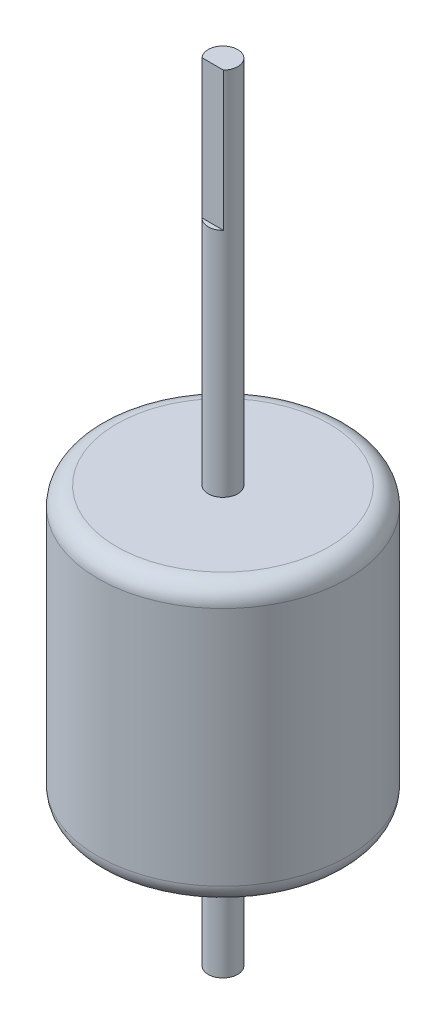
ISO-10303-21;
HEADER;
FILE_DESCRIPTION(('STEP AP214'),'2;1');
FILE_NAME('part.step','',(''),(''),'','','');
FILE_SCHEMA(('AUTOMOTIVE_DESIGN { 1 0 10303 214 1 1 1 1 }'));
ENDSEC;
DATA;
#1=APPLICATION_CONTEXT('core data for automotive mechanical design processes');
#2=APPLICATION_PROTOCOL_DEFINITION('international standard','automotive_design',2000,#1);
#3=PRODUCT_CONTEXT('',#1,'mechanical');
#4=PRODUCT('Part','Part','',(#3));
#5=PRODUCT_RELATED_PRODUCT_CATEGORY('part','',(#4));
#6=PRODUCT_DEFINITION_FORMATION('','',#4);
#7=PRODUCT_DEFINITION_CONTEXT('part definition',#1,'design');
#8=PRODUCT_DEFINITION('design','',#6,#7);
#9=PRODUCT_DEFINITION_SHAPE('','',#8);
#10=(LENGTH_UNIT() NAMED_UNIT(*) SI_UNIT(.MILLI.,.METRE.));
#11=(NAMED_UNIT(*) PLANE_ANGLE_UNIT() SI_UNIT($,.RADIAN.));
#12=(NAMED_UNIT(*) SI_UNIT($,.STERADIAN.) SOLID_ANGLE_UNIT());
#13=UNCERTAINTY_MEASURE_WITH_UNIT(LENGTH_MEASURE(1.E-05),#10,'distance_accuracy_value','');
#14=(GEOMETRIC_REPRESENTATION_CONTEXT(3) GLOBAL_UNCERTAINTY_ASSIGNED_CONTEXT((#13)) GLOBAL_UNIT_ASSIGNED_CONTEXT((#10,
#11,#12)) REPRESENTATION_CONTEXT('',''));
#15=CARTESIAN_POINT('',(0.,0.,0.));
#16=DIRECTION('',(0.,0.,1.));
#17=DIRECTION('',(1.,0.,0.));
#18=AXIS2_PLACEMENT_3D('',#15,#16,#17);
#19=CARTESIAN_POINT('',(0.,0.,0.));
#20=DIRECTION('',(0.,-1.,0.));
#21=DIRECTION('',(0.,0.,-1.));
#22=AXIS2_PLACEMENT_3D('',#19,#20,#21);
#23=CYLINDRICAL_SURFACE('',#22,1.6);
#24=CARTESIAN_POINT('',(0.,15.,0.));
#25=DIRECTION('',(0.,-1.,0.));
#26=DIRECTION('',(0.,0.,-1.));
#27=AXIS2_PLACEMENT_3D('',#24,#25,#26);
#28=CIRCLE('',#27,1.6);
#29=CARTESIAN_POINT('',(0.,15.,-1.6));
#30=VERTEX_POINT('',#29);
#31=EDGE_CURVE('E45',#30,#30,#28,.T.);
#32=ORIENTED_EDGE('',*,*,#31,.T.);
#33=EDGE_LOOP('',(#32));
#34=FACE_BOUND('',#33,.T.);
#35=CARTESIAN_POINT('',(0.,0.,0.));
#36=DIRECTION('',(0.,-1.,0.));
#37=DIRECTION('',(0.,0.,-1.));
#38=AXIS2_PLACEMENT_3D('',#35,#36,#37);
#39=CIRCLE('',#38,1.6);
#40=CARTESIAN_POINT('',(0.,0.,-1.6));
#41=VERTEX_POINT('',#40);
#42=EDGE_CURVE('E11',#41,#41,#39,.T.);
#43=ORIENTED_EDGE('',*,*,#42,.F.);
#44=EDGE_LOOP('',(#43));
#45=FACE_BOUND('',#44,.T.);
#46=ADVANCED_FACE('F41',(#34,#45),#23,.T.);
#47=CARTESIAN_POINT('',(0.,0.,0.));
#48=DIRECTION('',(0.,1.,0.));
#49=DIRECTION('',(0.,0.,1.));
#50=AXIS2_PLACEMENT_3D('',#47,#48,#49);
#51=PLANE('',#50);
#52=ORIENTED_EDGE('',*,*,#42,.T.);
#53=EDGE_LOOP('',(#52));
#54=FACE_BOUND('',#53,.T.);
#55=ADVANCED_FACE('F43',(#54),#51,.F.);
#56=CARTESIAN_POINT('',(0.,15.,0.));
#57=DIRECTION('',(0.,-1.,0.));
#58=DIRECTION('',(0.,0.,-1.));
#59=AXIS2_PLACEMENT_3D('',#56,#57,#58);
#60=PLANE('',#59);
#61=CARTESIAN_POINT('',(0.,15.,0.));
#62=DIRECTION('',(0.,-1.,0.));
#63=DIRECTION('',(0.,0.,-1.));
#64=AXIS2_PLACEMENT_3D('',#61,#62,#63);
#65=CIRCLE('',#64,11.5);
#66=CARTESIAN_POINT('',(0.,15.,-11.5));
#67=VERTEX_POINT('',#66);
#68=EDGE_CURVE('E88',#67,#67,#65,.T.);
#69=ORIENTED_EDGE('',*,*,#68,.T.);
#70=EDGE_LOOP('',(#69));
#71=FACE_BOUND('',#70,.T.);
#72=ORIENTED_EDGE('',*,*,#31,.F.);
#73=EDGE_LOOP('',(#72));
#74=FACE_BOUND('',#73,.T.);
#75=ADVANCED_FACE('F99',(#71,#74),#60,.T.);
#76=CARTESIAN_POINT('',(11.5,45.,0.));
#77=DIRECTION('',(0.,1.,0.));
#78=DIRECTION('',(0.,0.,1.));
#79=AXIS2_PLACEMENT_3D('',#76,#77,#78);
#80=PLANE('',#79);
#81=CARTESIAN_POINT('',(0.,45.,0.));
#82=DIRECTION('',(0.,-1.,0.));
#83=DIRECTION('',(0.,0.,-1.));
#84=AXIS2_PLACEMENT_3D('',#81,#82,#83);
#85=CIRCLE('',#84,11.5);
#86=CARTESIAN_POINT('',(0.,45.,-11.5));
#87=VERTEX_POINT('',#86);
#88=EDGE_CURVE('E154',#87,#87,#85,.T.);
#89=ORIENTED_EDGE('',*,*,#88,.F.);
#90=EDGE_LOOP('',(#89));
#91=FACE_BOUND('',#90,.T.);
#92=CARTESIAN_POINT('',(0.,45.,0.));
#93=DIRECTION('',(0.,1.,0.));
#94=DIRECTION('',(0.,0.,1.));
#95=AXIS2_PLACEMENT_3D('',#92,#93,#94);
#96=CIRCLE('',#95,1.6);
#97=CARTESIAN_POINT('',(0.,45.,1.6));
#98=VERTEX_POINT('',#97);
#99=EDGE_CURVE('E90',#98,#98,#96,.T.);
#100=ORIENTED_EDGE('',*,*,#99,.F.);
#101=EDGE_LOOP('',(#100));
#102=FACE_BOUND('',#101,.T.);
#103=ADVANCED_FACE('F101',(#91,#102),#80,.T.);
#104=CARTESIAN_POINT('',(0.,17.,0.));
#105=DIRECTION('',(0.,-1.,0.));
#106=DIRECTION('',(0.,0.,-1.));
#107=AXIS2_PLACEMENT_3D('',#104,#105,#106);
#108=TOROIDAL_SURFACE('',#107,11.5,2.);
#109=CARTESIAN_POINT('',(0.,17.,0.));
#110=DIRECTION('',(0.,-1.,0.));
#111=DIRECTION('',(0.,0.,-1.));
#112=AXIS2_PLACEMENT_3D('',#109,#110,#111);
#113=CIRCLE('',#112,13.5);
#114=CARTESIAN_POINT('',(0.,17.,-13.5));
#115=VERTEX_POINT('',#114);
#116=EDGE_CURVE('E148',#115,#115,#113,.T.);
#117=ORIENTED_EDGE('',*,*,#116,.T.);
#118=EDGE_LOOP('',(#117));
#119=FACE_BOUND('',#118,.T.);
#120=ORIENTED_EDGE('',*,*,#68,.F.);
#121=EDGE_LOOP('',(#120));
#122=FACE_BOUND('',#121,.T.);
#123=ADVANCED_FACE('F108',(#119,#122),#108,.T.);
#124=CARTESIAN_POINT('',(0.,0.,0.));
#125=DIRECTION('',(0.,-1.,0.));
#126=DIRECTION('',(0.,0.,-1.));
#127=AXIS2_PLACEMENT_3D('',#124,#125,#126);
#128=CYLINDRICAL_SURFACE('',#127,13.5);
#129=CARTESIAN_POINT('',(0.,43.,0.));
#130=DIRECTION('',(0.,-1.,0.));
#131=DIRECTION('',(0.,0.,-1.));
#132=AXIS2_PLACEMENT_3D('',#129,#130,#131);
#133=CIRCLE('',#132,13.5);
#134=CARTESIAN_POINT('',(0.,43.,-13.5));
#135=VERTEX_POINT('',#134);
#136=EDGE_CURVE('E151',#135,#135,#133,.T.);
#137=ORIENTED_EDGE('',*,*,#136,.T.);
#138=EDGE_LOOP('',(#137));
#139=FACE_BOUND('',#138,.T.);
#140=ORIENTED_EDGE('',*,*,#116,.F.);
#141=EDGE_LOOP('',(#140));
#142=FACE_BOUND('',#141,.T.);
#143=ADVANCED_FACE('F140',(#139,#142),#128,.T.);
#144=CARTESIAN_POINT('',(0.,43.,0.));
#145=DIRECTION('',(0.,-1.,0.));
#146=DIRECTION('',(0.,0.,-1.));
#147=AXIS2_PLACEMENT_3D('',#144,#145,#146);
#148=TOROIDAL_SURFACE('',#147,11.5,2.);
#149=ORIENTED_EDGE('',*,*,#88,.T.);
#150=EDGE_LOOP('',(#149));
#151=FACE_BOUND('',#150,.T.);
#152=ORIENTED_EDGE('',*,*,#136,.F.);
#153=EDGE_LOOP('',(#152));
#154=FACE_BOUND('',#153,.T.);
#155=ADVANCED_FACE('F135',(#151,#154),#148,.T.);
#156=CARTESIAN_POINT('',(0.,70.,0.));
#157=DIRECTION('',(0.,1.,0.));
#158=DIRECTION('',(0.,0.,1.));
#159=AXIS2_PLACEMENT_3D('',#156,#157,#158);
#160=PLANE('',#159);
#161=CARTESIAN_POINT('',(0.,70.,0.));
#162=DIRECTION('',(0.,1.,0.));
#163=DIRECTION('',(0.,0.,1.));
#164=AXIS2_PLACEMENT_3D('',#161,#162,#163);
#165=CIRCLE('',#164,1.6);
#166=CARTESIAN_POINT('',(-1.16189500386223,70.,1.1));
#167=VERTEX_POINT('',#166);
#168=CARTESIAN_POINT('',(1.16189500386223,70.,1.1));
#169=VERTEX_POINT('',#168);
#170=EDGE_CURVE('E74',#167,#169,#165,.T.);
#171=ORIENTED_EDGE('',*,*,#170,.T.);
#172=DIRECTION('',(-1.,0.,0.));
#173=VECTOR('',#172,1.);
#174=CARTESIAN_POINT('',(-1.16189500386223,70.,1.1));
#175=LINE('',#174,#173);
#176=EDGE_CURVE('E143',#169,#167,#175,.T.);
#177=ORIENTED_EDGE('',*,*,#176,.T.);
#178=EDGE_LOOP('',(#171,#177));
#179=FACE_BOUND('',#178,.T.);
#180=ADVANCED_FACE('F132',(#179),#160,.T.);
#181=CARTESIAN_POINT('',(-1.16189500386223,70.,1.1));
#182=DIRECTION('',(0.,0.,-1.));
#183=DIRECTION('',(-1.,0.,0.));
#184=AXIS2_PLACEMENT_3D('',#181,#182,#183);
#185=PLANE('',#184);
#186=DIRECTION('',(-1.,0.,0.));
#187=VECTOR('',#186,1.);
#188=CARTESIAN_POINT('',(-1.16189500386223,85.,1.1));
#189=LINE('',#188,#187);
#190=CARTESIAN_POINT('',(1.16189500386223,85.,1.1));
#191=VERTEX_POINT('',#190);
#192=CARTESIAN_POINT('',(-1.16189500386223,85.,1.1));
#193=VERTEX_POINT('',#192);
#194=EDGE_CURVE('E69',#191,#193,#189,.T.);
#195=ORIENTED_EDGE('',*,*,#194,.T.);
#196=DIRECTION('',(0.,1.,0.));
#197=VECTOR('',#196,1.);
#198=CARTESIAN_POINT('',(-1.16189500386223,70.,1.1));
#199=LINE('',#198,#197);
#200=EDGE_CURVE('E64',#167,#193,#199,.T.);
#201=ORIENTED_EDGE('',*,*,#200,.F.);
#202=ORIENTED_EDGE('',*,*,#176,.F.);
#203=DIRECTION('',(0.,1.,0.));
#204=VECTOR('',#203,1.);
#205=CARTESIAN_POINT('',(1.16189500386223,70.,1.1));
#206=LINE('',#205,#204);
#207=EDGE_CURVE('E58',#169,#191,#206,.T.);
#208=ORIENTED_EDGE('',*,*,#207,.T.);
#209=EDGE_LOOP('',(#195,#201,#202,#208));
#210=FACE_BOUND('',#209,.T.);
#211=ADVANCED_FACE('F70',(#210),#185,.F.);
#212=CARTESIAN_POINT('',(-1.6,85.,0.));
#213=DIRECTION('',(0.,-1.,0.));
#214=DIRECTION('',(0.,0.,-1.));
#215=AXIS2_PLACEMENT_3D('',#212,#213,#214);
#216=PLANE('',#215);
#217=CARTESIAN_POINT('',(0.,85.,0.));
#218=DIRECTION('',(0.,-1.,0.));
#219=DIRECTION('',(0.,0.,-1.));
#220=AXIS2_PLACEMENT_3D('',#217,#218,#219);
#221=CIRCLE('',#220,1.6);
#222=EDGE_CURVE('E50',#193,#191,#221,.T.);
#223=ORIENTED_EDGE('',*,*,#222,.F.);
#224=ORIENTED_EDGE('',*,*,#194,.F.);
#225=EDGE_LOOP('',(#223,#224));
#226=FACE_BOUND('',#225,.T.);
#227=ADVANCED_FACE('F80',(#226),#216,.F.);
#228=ORIENTED_EDGE('',*,*,#99,.T.);
#229=EDGE_LOOP('',(#228));
#230=FACE_BOUND('',#229,.T.);
#231=ORIENTED_EDGE('',*,*,#222,.T.);
#232=ORIENTED_EDGE('',*,*,#207,.F.);
#233=ORIENTED_EDGE('',*,*,#170,.F.);
#234=ORIENTED_EDGE('',*,*,#200,.T.);
#235=EDGE_LOOP('',(#231,#232,#233,#234));
#236=FACE_BOUND('',#235,.T.);
#237=ADVANCED_FACE('F78',(#230,#236),#23,.T.);
#238=CLOSED_SHELL('',(#46,#55,#75,#103,#123,#143,#155,#180,#211,#227,#237));
#239=CARTESIAN_POINT('',(0.,44.5,0.));
#240=DIRECTION('',(0.,-1.,0.));
#241=DIRECTION('',(0.,0.,-1.));
#242=AXIS2_PLACEMENT_3D('',#239,#240,#241);
#243=PLANE('',#242);
#244=CARTESIAN_POINT('',(0.,44.5,0.));
#245=DIRECTION('',(0.,-1.,0.));
#246=DIRECTION('',(0.,0.,-1.));
#247=AXIS2_PLACEMENT_3D('',#244,#245,#246);
#248=CIRCLE('',#247,10.);
#249=CARTESIAN_POINT('',(0.,44.5,-10.));
#250=VERTEX_POINT('',#249);
#251=EDGE_CURVE('E157',#250,#250,#248,.T.);
#252=ORIENTED_EDGE('',*,*,#251,.T.);
#253=EDGE_LOOP('',(#252));
#254=FACE_BOUND('',#253,.T.);
#255=CARTESIAN_POINT('',(0.,44.5,0.));
#256=DIRECTION('',(0.,-1.,0.));
#257=DIRECTION('',(0.,0.,-1.));
#258=AXIS2_PLACEMENT_3D('',#255,#256,#257);
#259=CIRCLE('',#258,1.6);
#260=CARTESIAN_POINT('',(0.,44.5,-1.6));
#261=VERTEX_POINT('',#260);
#262=EDGE_CURVE('E87',#261,#261,#259,.T.);
#263=ORIENTED_EDGE('',*,*,#262,.F.);
#264=EDGE_LOOP('',(#263));
#265=FACE_BOUND('',#264,.T.);
#266=ADVANCED_FACE('F169',(#254,#265),#243,.T.);
#267=CARTESIAN_POINT('',(0.,15.5,0.));
#268=DIRECTION('',(0.,1.,0.));
#269=DIRECTION('',(0.,0.,1.));
#270=AXIS2_PLACEMENT_3D('',#267,#268,#269);
#271=PLANE('',#270);
#272=CARTESIAN_POINT('',(0.,15.5,0.));
#273=DIRECTION('',(0.,-1.,0.));
#274=DIRECTION('',(0.,0.,-1.));
#275=AXIS2_PLACEMENT_3D('',#272,#273,#274);
#276=CIRCLE('',#275,10.);
#277=CARTESIAN_POINT('',(0.,15.5,-10.));
#278=VERTEX_POINT('',#277);
#279=EDGE_CURVE('E160',#278,#278,#276,.T.);
#280=ORIENTED_EDGE('',*,*,#279,.F.);
#281=EDGE_LOOP('',(#280));
#282=FACE_BOUND('',#281,.T.);
#283=CARTESIAN_POINT('',(0.,15.5,0.));
#284=DIRECTION('',(0.,1.,0.));
#285=DIRECTION('',(0.,0.,1.));
#286=AXIS2_PLACEMENT_3D('',#283,#284,#285);
#287=CIRCLE('',#286,1.6);
#288=CARTESIAN_POINT('',(0.,15.5,1.6));
#289=VERTEX_POINT('',#288);
#290=EDGE_CURVE('E84',#289,#289,#287,.T.);
#291=ORIENTED_EDGE('',*,*,#290,.F.);
#292=EDGE_LOOP('',(#291));
#293=FACE_BOUND('',#292,.T.);
#294=ADVANCED_FACE('F166',(#282,#293),#271,.T.);
#295=CARTESIAN_POINT('',(0.,0.,0.));
#296=DIRECTION('',(0.,-1.,0.));
#297=DIRECTION('',(0.,0.,-1.));
#298=AXIS2_PLACEMENT_3D('',#295,#296,#297);
#299=CYLINDRICAL_SURFACE('',#298,10.);
#300=ORIENTED_EDGE('',*,*,#279,.T.);
#301=EDGE_LOOP('',(#300));
#302=FACE_BOUND('',#301,.T.);
#303=ORIENTED_EDGE('',*,*,#251,.F.);
#304=EDGE_LOOP('',(#303));
#305=FACE_BOUND('',#304,.T.);
#306=ADVANCED_FACE('F121',(#302,#305),#299,.F.);
#307=ORIENTED_EDGE('',*,*,#262,.T.);
#308=EDGE_LOOP('',(#307));
#309=FACE_BOUND('',#308,.T.);
#310=ORIENTED_EDGE('',*,*,#290,.T.);
#311=EDGE_LOOP('',(#310));
#312=FACE_BOUND('',#311,.T.);
#313=ADVANCED_FACE('F116',(#309,#312),#23,.T.);
#314=CLOSED_SHELL('',(#266,#294,#306,#313));
#315=ORIENTED_CLOSED_SHELL('',*,#314,.T.);
#316=BREP_WITH_VOIDS('B2',#238,(#315));
#317=ADVANCED_BREP_SHAPE_REPRESENTATION('',(#18,#316),#14);
#318=SHAPE_DEFINITION_REPRESENTATION(#9,#317);
ENDSEC;
END-ISO-10303-21;
